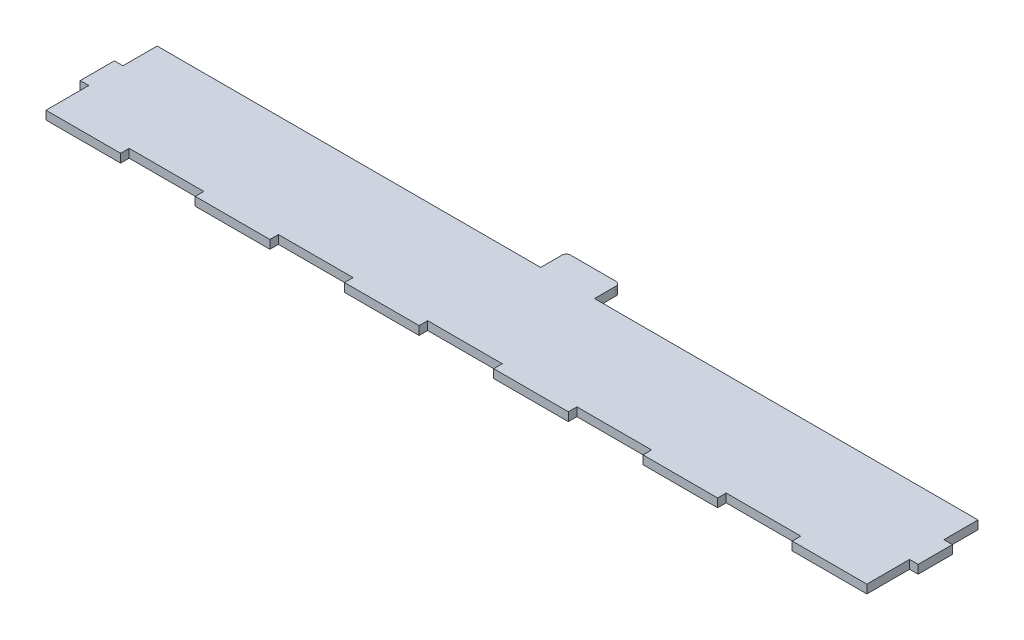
ISO-10303-21;
HEADER;
FILE_DESCRIPTION(('STEP AP214'),'2;1');
FILE_NAME('part.step','',(''),(''),'','','');
FILE_SCHEMA(('AUTOMOTIVE_DESIGN { 1 0 10303 214 1 1 1 1 }'));
ENDSEC;
DATA;
#1=APPLICATION_CONTEXT('core data for automotive mechanical design processes');
#2=APPLICATION_PROTOCOL_DEFINITION('international standard','automotive_design',2000,#1);
#3=PRODUCT_CONTEXT('',#1,'mechanical');
#4=PRODUCT('Part','Part','',(#3));
#5=PRODUCT_RELATED_PRODUCT_CATEGORY('part','',(#4));
#6=PRODUCT_DEFINITION_FORMATION('','',#4);
#7=PRODUCT_DEFINITION_CONTEXT('part definition',#1,'design');
#8=PRODUCT_DEFINITION('design','',#6,#7);
#9=PRODUCT_DEFINITION_SHAPE('','',#8);
#10=(LENGTH_UNIT() NAMED_UNIT(*) SI_UNIT(.MILLI.,.METRE.));
#11=(NAMED_UNIT(*) PLANE_ANGLE_UNIT() SI_UNIT($,.RADIAN.));
#12=(NAMED_UNIT(*) SI_UNIT($,.STERADIAN.) SOLID_ANGLE_UNIT());
#13=UNCERTAINTY_MEASURE_WITH_UNIT(LENGTH_MEASURE(1.E-05),#10,'distance_accuracy_value','');
#14=(GEOMETRIC_REPRESENTATION_CONTEXT(3) GLOBAL_UNCERTAINTY_ASSIGNED_CONTEXT((#13)) GLOBAL_UNIT_ASSIGNED_CONTEXT((#10,
#11,#12)) REPRESENTATION_CONTEXT('',''));
#15=CARTESIAN_POINT('',(0.,0.,0.));
#16=DIRECTION('',(0.,0.,1.));
#17=DIRECTION('',(1.,0.,0.));
#18=AXIS2_PLACEMENT_3D('',#15,#16,#17);
#19=CARTESIAN_POINT('',(-152.4,3.175,-25.4));
#20=DIRECTION('',(1.,0.,0.));
#21=DIRECTION('',(0.,0.,-1.));
#22=AXIS2_PLACEMENT_3D('',#19,#20,#21);
#23=PLANE('',#22);
#24=DIRECTION('',(0.,0.,1.));
#25=VECTOR('',#24,1.);
#26=CARTESIAN_POINT('',(-152.4,0.,-25.4));
#27=LINE('',#26,#25);
#28=CARTESIAN_POINT('',(-152.4,0.,-38.1));
#29=VERTEX_POINT('',#28);
#30=CARTESIAN_POINT('',(-152.4,0.,-25.4));
#31=VERTEX_POINT('',#30);
#32=EDGE_CURVE('E603',#29,#31,#27,.T.);
#33=ORIENTED_EDGE('',*,*,#32,.T.);
#34=DIRECTION('',(0.,-1.,0.));
#35=VECTOR('',#34,1.);
#36=CARTESIAN_POINT('',(-152.4,3.175,-25.4));
#37=LINE('',#36,#35);
#38=CARTESIAN_POINT('',(-152.4,3.175,-25.4));
#39=VERTEX_POINT('',#38);
#40=EDGE_CURVE('E12',#39,#31,#37,.T.);
#41=ORIENTED_EDGE('',*,*,#40,.F.);
#42=DIRECTION('',(0.,0.,1.));
#43=VECTOR('',#42,1.);
#44=CARTESIAN_POINT('',(-152.4,3.175,-25.4));
#45=LINE('',#44,#43);
#46=CARTESIAN_POINT('',(-152.4,3.175,-38.1));
#47=VERTEX_POINT('',#46);
#48=EDGE_CURVE('E479',#47,#39,#45,.T.);
#49=ORIENTED_EDGE('',*,*,#48,.F.);
#50=DIRECTION('',(0.,-1.,0.));
#51=VECTOR('',#50,1.);
#52=CARTESIAN_POINT('',(-152.4,3.175,-38.1));
#53=LINE('',#52,#51);
#54=EDGE_CURVE('E311',#47,#29,#53,.T.);
#55=ORIENTED_EDGE('',*,*,#54,.T.);
#56=EDGE_LOOP('',(#33,#41,#49,#55));
#57=FACE_BOUND('',#56,.T.);
#58=ADVANCED_FACE('F36',(#57),#23,.F.);
#59=CARTESIAN_POINT('',(-155.575,3.175,-25.4));
#60=DIRECTION('',(0.,0.,1.));
#61=DIRECTION('',(1.,0.,0.));
#62=AXIS2_PLACEMENT_3D('',#59,#60,#61);
#63=PLANE('',#62);
#64=DIRECTION('',(-1.,0.,0.));
#65=VECTOR('',#64,1.);
#66=CARTESIAN_POINT('',(-155.575,0.,-25.4));
#67=LINE('',#66,#65);
#68=CARTESIAN_POINT('',(-155.575,0.,-25.4));
#69=VERTEX_POINT('',#68);
#70=EDGE_CURVE('E597',#31,#69,#67,.T.);
#71=ORIENTED_EDGE('',*,*,#70,.T.);
#72=DIRECTION('',(0.,-1.,0.));
#73=VECTOR('',#72,1.);
#74=CARTESIAN_POINT('',(-155.575,3.175,-25.4));
#75=LINE('',#74,#73);
#76=CARTESIAN_POINT('',(-155.575,3.175,-25.4));
#77=VERTEX_POINT('',#76);
#78=EDGE_CURVE('E44',#77,#69,#75,.T.);
#79=ORIENTED_EDGE('',*,*,#78,.F.);
#80=DIRECTION('',(-1.,0.,0.));
#81=VECTOR('',#80,1.);
#82=CARTESIAN_POINT('',(-155.575,3.175,-25.4));
#83=LINE('',#82,#81);
#84=EDGE_CURVE('E185',#39,#77,#83,.T.);
#85=ORIENTED_EDGE('',*,*,#84,.F.);
#86=ORIENTED_EDGE('',*,*,#40,.T.);
#87=EDGE_LOOP('',(#71,#79,#85,#86));
#88=FACE_BOUND('',#87,.T.);
#89=ADVANCED_FACE('F684',(#88),#63,.F.);
#90=CARTESIAN_POINT('',(-155.575,3.175,-12.7));
#91=DIRECTION('',(1.,0.,0.));
#92=DIRECTION('',(0.,0.,-1.));
#93=AXIS2_PLACEMENT_3D('',#90,#91,#92);
#94=PLANE('',#93);
#95=DIRECTION('',(0.,0.,1.));
#96=VECTOR('',#95,1.);
#97=CARTESIAN_POINT('',(-155.575,0.,-12.7));
#98=LINE('',#97,#96);
#99=CARTESIAN_POINT('',(-155.575,0.,-12.7));
#100=VERTEX_POINT('',#99);
#101=EDGE_CURVE('E592',#69,#100,#98,.T.);
#102=ORIENTED_EDGE('',*,*,#101,.T.);
#103=DIRECTION('',(0.,-1.,0.));
#104=VECTOR('',#103,1.);
#105=CARTESIAN_POINT('',(-155.575,3.175,-12.7));
#106=LINE('',#105,#104);
#107=CARTESIAN_POINT('',(-155.575,3.175,-12.7));
#108=VERTEX_POINT('',#107);
#109=EDGE_CURVE('E584',#108,#100,#106,.T.);
#110=ORIENTED_EDGE('',*,*,#109,.F.);
#111=DIRECTION('',(0.,0.,1.));
#112=VECTOR('',#111,1.);
#113=CARTESIAN_POINT('',(-155.575,3.175,-12.7));
#114=LINE('',#113,#112);
#115=EDGE_CURVE('E473',#77,#108,#114,.T.);
#116=ORIENTED_EDGE('',*,*,#115,.F.);
#117=ORIENTED_EDGE('',*,*,#78,.T.);
#118=EDGE_LOOP('',(#102,#110,#116,#117));
#119=FACE_BOUND('',#118,.T.);
#120=ADVANCED_FACE('F590',(#119),#94,.F.);
#121=CARTESIAN_POINT('',(-152.4,3.175,-12.7));
#122=DIRECTION('',(0.,0.,-1.));
#123=DIRECTION('',(-1.,0.,0.));
#124=AXIS2_PLACEMENT_3D('',#121,#122,#123);
#125=PLANE('',#124);
#126=DIRECTION('',(1.,0.,0.));
#127=VECTOR('',#126,1.);
#128=CARTESIAN_POINT('',(-152.4,0.,-12.7));
#129=LINE('',#128,#127);
#130=CARTESIAN_POINT('',(-152.4,0.,-12.7));
#131=VERTEX_POINT('',#130);
#132=EDGE_CURVE('E599',#100,#131,#129,.T.);
#133=ORIENTED_EDGE('',*,*,#132,.T.);
#134=DIRECTION('',(0.,-1.,0.));
#135=VECTOR('',#134,1.);
#136=CARTESIAN_POINT('',(-152.4,3.175,-12.7));
#137=LINE('',#136,#135);
#138=CARTESIAN_POINT('',(-152.4,3.175,-12.7));
#139=VERTEX_POINT('',#138);
#140=EDGE_CURVE('E581',#139,#131,#137,.T.);
#141=ORIENTED_EDGE('',*,*,#140,.F.);
#142=DIRECTION('',(1.,0.,0.));
#143=VECTOR('',#142,1.);
#144=CARTESIAN_POINT('',(-152.4,3.175,-12.7));
#145=LINE('',#144,#143);
#146=EDGE_CURVE('E465',#108,#139,#145,.T.);
#147=ORIENTED_EDGE('',*,*,#146,.F.);
#148=ORIENTED_EDGE('',*,*,#109,.T.);
#149=EDGE_LOOP('',(#133,#141,#147,#148));
#150=FACE_BOUND('',#149,.T.);
#151=ADVANCED_FACE('F691',(#150),#125,.F.);
#152=CARTESIAN_POINT('',(-152.4,3.175,3.17500000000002));
#153=DIRECTION('',(1.,0.,0.));
#154=DIRECTION('',(0.,0.,-1.));
#155=AXIS2_PLACEMENT_3D('',#152,#153,#154);
#156=PLANE('',#155);
#157=DIRECTION('',(0.,0.,1.));
#158=VECTOR('',#157,1.);
#159=CARTESIAN_POINT('',(-152.4,0.,3.17500000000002));
#160=LINE('',#159,#158);
#161=CARTESIAN_POINT('',(-152.4,0.,3.17500000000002));
#162=VERTEX_POINT('',#161);
#163=EDGE_CURVE('E601',#131,#162,#160,.T.);
#164=ORIENTED_EDGE('',*,*,#163,.T.);
#165=DIRECTION('',(0.,-1.,0.));
#166=VECTOR('',#165,1.);
#167=CARTESIAN_POINT('',(-152.4,3.175,3.17500000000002));
#168=LINE('',#167,#166);
#169=CARTESIAN_POINT('',(-152.4,3.175,3.17500000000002));
#170=VERTEX_POINT('',#169);
#171=EDGE_CURVE('E578',#170,#162,#168,.T.);
#172=ORIENTED_EDGE('',*,*,#171,.F.);
#173=DIRECTION('',(0.,0.,1.));
#174=VECTOR('',#173,1.);
#175=CARTESIAN_POINT('',(-152.4,3.175,3.17500000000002));
#176=LINE('',#175,#174);
#177=EDGE_CURVE('E461',#139,#170,#176,.T.);
#178=ORIENTED_EDGE('',*,*,#177,.F.);
#179=ORIENTED_EDGE('',*,*,#140,.T.);
#180=EDGE_LOOP('',(#164,#172,#178,#179));
#181=FACE_BOUND('',#180,.T.);
#182=ADVANCED_FACE('F696',(#181),#156,.F.);
#183=CARTESIAN_POINT('',(-124.690909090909,3.175,3.17500000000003));
#184=DIRECTION('',(0.,0.,-1.));
#185=DIRECTION('',(-1.,0.,0.));
#186=AXIS2_PLACEMENT_3D('',#183,#184,#185);
#187=PLANE('',#186);
#188=DIRECTION('',(1.,0.,0.));
#189=VECTOR('',#188,1.);
#190=CARTESIAN_POINT('',(-124.690909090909,0.,3.17500000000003));
#191=LINE('',#190,#189);
#192=CARTESIAN_POINT('',(-124.690909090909,0.,3.17500000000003));
#193=VERTEX_POINT('',#192);
#194=EDGE_CURVE('E607',#162,#193,#191,.T.);
#195=ORIENTED_EDGE('',*,*,#194,.T.);
#196=DIRECTION('',(0.,-1.,0.));
#197=VECTOR('',#196,1.);
#198=CARTESIAN_POINT('',(-124.690909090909,3.175,3.17500000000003));
#199=LINE('',#198,#197);
#200=CARTESIAN_POINT('',(-124.690909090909,3.175,3.17500000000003));
#201=VERTEX_POINT('',#200);
#202=EDGE_CURVE('E575',#201,#193,#199,.T.);
#203=ORIENTED_EDGE('',*,*,#202,.F.);
#204=DIRECTION('',(1.,0.,0.));
#205=VECTOR('',#204,1.);
#206=CARTESIAN_POINT('',(-124.690909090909,3.175,3.17500000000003));
#207=LINE('',#206,#205);
#208=EDGE_CURVE('E457',#170,#201,#207,.T.);
#209=ORIENTED_EDGE('',*,*,#208,.F.);
#210=ORIENTED_EDGE('',*,*,#171,.T.);
#211=EDGE_LOOP('',(#195,#203,#209,#210));
#212=FACE_BOUND('',#211,.T.);
#213=ADVANCED_FACE('F700',(#212),#187,.F.);
#214=CARTESIAN_POINT('',(-124.690909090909,3.175,0.));
#215=DIRECTION('',(-1.,0.,0.));
#216=DIRECTION('',(0.,0.,1.));
#217=AXIS2_PLACEMENT_3D('',#214,#215,#216);
#218=PLANE('',#217);
#219=DIRECTION('',(0.,0.,-1.));
#220=VECTOR('',#219,1.);
#221=CARTESIAN_POINT('',(-124.690909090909,0.,0.));
#222=LINE('',#221,#220);
#223=CARTESIAN_POINT('',(-124.690909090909,0.,0.));
#224=VERTEX_POINT('',#223);
#225=EDGE_CURVE('E609',#193,#224,#222,.T.);
#226=ORIENTED_EDGE('',*,*,#225,.T.);
#227=DIRECTION('',(0.,-1.,0.));
#228=VECTOR('',#227,1.);
#229=CARTESIAN_POINT('',(-124.690909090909,3.175,0.));
#230=LINE('',#229,#228);
#231=CARTESIAN_POINT('',(-124.690909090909,3.175,0.));
#232=VERTEX_POINT('',#231);
#233=EDGE_CURVE('E572',#232,#224,#230,.T.);
#234=ORIENTED_EDGE('',*,*,#233,.F.);
#235=DIRECTION('',(0.,0.,-1.));
#236=VECTOR('',#235,1.);
#237=CARTESIAN_POINT('',(-124.690909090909,3.175,0.));
#238=LINE('',#237,#236);
#239=EDGE_CURVE('E454',#201,#232,#238,.T.);
#240=ORIENTED_EDGE('',*,*,#239,.F.);
#241=ORIENTED_EDGE('',*,*,#202,.T.);
#242=EDGE_LOOP('',(#226,#234,#240,#241));
#243=FACE_BOUND('',#242,.T.);
#244=ADVANCED_FACE('F704',(#243),#218,.F.);
#245=CARTESIAN_POINT('',(-96.9818181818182,3.175,0.));
#246=DIRECTION('',(0.,0.,-1.));
#247=DIRECTION('',(-1.,0.,0.));
#248=AXIS2_PLACEMENT_3D('',#245,#246,#247);
#249=PLANE('',#248);
#250=DIRECTION('',(1.,0.,0.));
#251=VECTOR('',#250,1.);
#252=CARTESIAN_POINT('',(-96.9818181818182,0.,0.));
#253=LINE('',#252,#251);
#254=CARTESIAN_POINT('',(-96.9818181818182,0.,0.));
#255=VERTEX_POINT('',#254);
#256=EDGE_CURVE('E611',#224,#255,#253,.T.);
#257=ORIENTED_EDGE('',*,*,#256,.T.);
#258=DIRECTION('',(0.,-1.,0.));
#259=VECTOR('',#258,1.);
#260=CARTESIAN_POINT('',(-96.9818181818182,3.175,0.));
#261=LINE('',#260,#259);
#262=CARTESIAN_POINT('',(-96.9818181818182,3.175,0.));
#263=VERTEX_POINT('',#262);
#264=EDGE_CURVE('E569',#263,#255,#261,.T.);
#265=ORIENTED_EDGE('',*,*,#264,.F.);
#266=DIRECTION('',(1.,0.,0.));
#267=VECTOR('',#266,1.);
#268=CARTESIAN_POINT('',(-96.9818181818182,3.175,0.));
#269=LINE('',#268,#267);
#270=EDGE_CURVE('E446',#232,#263,#269,.T.);
#271=ORIENTED_EDGE('',*,*,#270,.F.);
#272=ORIENTED_EDGE('',*,*,#233,.T.);
#273=EDGE_LOOP('',(#257,#265,#271,#272));
#274=FACE_BOUND('',#273,.T.);
#275=ADVANCED_FACE('F708',(#274),#249,.F.);
#276=CARTESIAN_POINT('',(-96.9818181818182,3.175,3.17500000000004));
#277=DIRECTION('',(1.,0.,0.));
#278=DIRECTION('',(0.,0.,-1.));
#279=AXIS2_PLACEMENT_3D('',#276,#277,#278);
#280=PLANE('',#279);
#281=DIRECTION('',(0.,0.,1.));
#282=VECTOR('',#281,1.);
#283=CARTESIAN_POINT('',(-96.9818181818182,0.,3.17500000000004));
#284=LINE('',#283,#282);
#285=CARTESIAN_POINT('',(-96.9818181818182,0.,3.17500000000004));
#286=VERTEX_POINT('',#285);
#287=EDGE_CURVE('E613',#255,#286,#284,.T.);
#288=ORIENTED_EDGE('',*,*,#287,.T.);
#289=DIRECTION('',(0.,-1.,0.));
#290=VECTOR('',#289,1.);
#291=CARTESIAN_POINT('',(-96.9818181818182,3.175,3.17500000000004));
#292=LINE('',#291,#290);
#293=CARTESIAN_POINT('',(-96.9818181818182,3.175,3.17500000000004));
#294=VERTEX_POINT('',#293);
#295=EDGE_CURVE('E566',#294,#286,#292,.T.);
#296=ORIENTED_EDGE('',*,*,#295,.F.);
#297=DIRECTION('',(0.,0.,1.));
#298=VECTOR('',#297,1.);
#299=CARTESIAN_POINT('',(-96.9818181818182,3.175,3.17500000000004));
#300=LINE('',#299,#298);
#301=EDGE_CURVE('E442',#263,#294,#300,.T.);
#302=ORIENTED_EDGE('',*,*,#301,.F.);
#303=ORIENTED_EDGE('',*,*,#264,.T.);
#304=EDGE_LOOP('',(#288,#296,#302,#303));
#305=FACE_BOUND('',#304,.T.);
#306=ADVANCED_FACE('F712',(#305),#280,.F.);
#307=CARTESIAN_POINT('',(-69.2727272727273,3.175,3.17500000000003));
#308=DIRECTION('',(0.,0.,-1.));
#309=DIRECTION('',(-1.,0.,0.));
#310=AXIS2_PLACEMENT_3D('',#307,#308,#309);
#311=PLANE('',#310);
#312=DIRECTION('',(1.,0.,0.));
#313=VECTOR('',#312,1.);
#314=CARTESIAN_POINT('',(-69.2727272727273,0.,3.17500000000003));
#315=LINE('',#314,#313);
#316=CARTESIAN_POINT('',(-69.2727272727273,0.,3.17500000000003));
#317=VERTEX_POINT('',#316);
#318=EDGE_CURVE('E615',#286,#317,#315,.T.);
#319=ORIENTED_EDGE('',*,*,#318,.T.);
#320=DIRECTION('',(0.,-1.,0.));
#321=VECTOR('',#320,1.);
#322=CARTESIAN_POINT('',(-69.2727272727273,3.175,3.17500000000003));
#323=LINE('',#322,#321);
#324=CARTESIAN_POINT('',(-69.2727272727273,3.175,3.17500000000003));
#325=VERTEX_POINT('',#324);
#326=EDGE_CURVE('E563',#325,#317,#323,.T.);
#327=ORIENTED_EDGE('',*,*,#326,.F.);
#328=DIRECTION('',(1.,0.,0.));
#329=VECTOR('',#328,1.);
#330=CARTESIAN_POINT('',(-69.2727272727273,3.175,3.17500000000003));
#331=LINE('',#330,#329);
#332=EDGE_CURVE('E438',#294,#325,#331,.T.);
#333=ORIENTED_EDGE('',*,*,#332,.F.);
#334=ORIENTED_EDGE('',*,*,#295,.T.);
#335=EDGE_LOOP('',(#319,#327,#333,#334));
#336=FACE_BOUND('',#335,.T.);
#337=ADVANCED_FACE('F716',(#336),#311,.F.);
#338=CARTESIAN_POINT('',(-69.2727272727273,3.175,0.));
#339=DIRECTION('',(-1.,0.,0.));
#340=DIRECTION('',(0.,0.,1.));
#341=AXIS2_PLACEMENT_3D('',#338,#339,#340);
#342=PLANE('',#341);
#343=DIRECTION('',(0.,0.,-1.));
#344=VECTOR('',#343,1.);
#345=CARTESIAN_POINT('',(-69.2727272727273,0.,0.));
#346=LINE('',#345,#344);
#347=CARTESIAN_POINT('',(-69.2727272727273,0.,0.));
#348=VERTEX_POINT('',#347);
#349=EDGE_CURVE('E617',#317,#348,#346,.T.);
#350=ORIENTED_EDGE('',*,*,#349,.T.);
#351=DIRECTION('',(0.,-1.,0.));
#352=VECTOR('',#351,1.);
#353=CARTESIAN_POINT('',(-69.2727272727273,3.175,0.));
#354=LINE('',#353,#352);
#355=CARTESIAN_POINT('',(-69.2727272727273,3.175,0.));
#356=VERTEX_POINT('',#355);
#357=EDGE_CURVE('E560',#356,#348,#354,.T.);
#358=ORIENTED_EDGE('',*,*,#357,.F.);
#359=DIRECTION('',(0.,0.,-1.));
#360=VECTOR('',#359,1.);
#361=CARTESIAN_POINT('',(-69.2727272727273,3.175,0.));
#362=LINE('',#361,#360);
#363=EDGE_CURVE('E435',#325,#356,#362,.T.);
#364=ORIENTED_EDGE('',*,*,#363,.F.);
#365=ORIENTED_EDGE('',*,*,#326,.T.);
#366=EDGE_LOOP('',(#350,#358,#364,#365));
#367=FACE_BOUND('',#366,.T.);
#368=ADVANCED_FACE('F720',(#367),#342,.F.);
#369=CARTESIAN_POINT('',(-41.5636363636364,3.175,0.));
#370=DIRECTION('',(0.,0.,-1.));
#371=DIRECTION('',(-1.,0.,0.));
#372=AXIS2_PLACEMENT_3D('',#369,#370,#371);
#373=PLANE('',#372);
#374=DIRECTION('',(1.,0.,0.));
#375=VECTOR('',#374,1.);
#376=CARTESIAN_POINT('',(-41.5636363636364,0.,0.));
#377=LINE('',#376,#375);
#378=CARTESIAN_POINT('',(-41.5636363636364,0.,0.));
#379=VERTEX_POINT('',#378);
#380=EDGE_CURVE('E619',#348,#379,#377,.T.);
#381=ORIENTED_EDGE('',*,*,#380,.T.);
#382=DIRECTION('',(0.,-1.,0.));
#383=VECTOR('',#382,1.);
#384=CARTESIAN_POINT('',(-41.5636363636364,3.175,0.));
#385=LINE('',#384,#383);
#386=CARTESIAN_POINT('',(-41.5636363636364,3.175,0.));
#387=VERTEX_POINT('',#386);
#388=EDGE_CURVE('E557',#387,#379,#385,.T.);
#389=ORIENTED_EDGE('',*,*,#388,.F.);
#390=DIRECTION('',(1.,0.,0.));
#391=VECTOR('',#390,1.);
#392=CARTESIAN_POINT('',(-41.5636363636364,3.175,0.));
#393=LINE('',#392,#391);
#394=EDGE_CURVE('E427',#356,#387,#393,.T.);
#395=ORIENTED_EDGE('',*,*,#394,.F.);
#396=ORIENTED_EDGE('',*,*,#357,.T.);
#397=EDGE_LOOP('',(#381,#389,#395,#396));
#398=FACE_BOUND('',#397,.T.);
#399=ADVANCED_FACE('F724',(#398),#373,.F.);
#400=CARTESIAN_POINT('',(-41.5636363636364,3.175,3.17500000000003));
#401=DIRECTION('',(1.,0.,0.));
#402=DIRECTION('',(0.,0.,-1.));
#403=AXIS2_PLACEMENT_3D('',#400,#401,#402);
#404=PLANE('',#403);
#405=DIRECTION('',(0.,0.,1.));
#406=VECTOR('',#405,1.);
#407=CARTESIAN_POINT('',(-41.5636363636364,0.,3.17500000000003));
#408=LINE('',#407,#406);
#409=CARTESIAN_POINT('',(-41.5636363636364,0.,3.17500000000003));
#410=VERTEX_POINT('',#409);
#411=EDGE_CURVE('E621',#379,#410,#408,.T.);
#412=ORIENTED_EDGE('',*,*,#411,.T.);
#413=DIRECTION('',(0.,-1.,0.));
#414=VECTOR('',#413,1.);
#415=CARTESIAN_POINT('',(-41.5636363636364,3.175,3.17500000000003));
#416=LINE('',#415,#414);
#417=CARTESIAN_POINT('',(-41.5636363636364,3.175,3.17500000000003));
#418=VERTEX_POINT('',#417);
#419=EDGE_CURVE('E554',#418,#410,#416,.T.);
#420=ORIENTED_EDGE('',*,*,#419,.F.);
#421=DIRECTION('',(0.,0.,1.));
#422=VECTOR('',#421,1.);
#423=CARTESIAN_POINT('',(-41.5636363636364,3.175,3.17500000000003));
#424=LINE('',#423,#422);
#425=EDGE_CURVE('E423',#387,#418,#424,.T.);
#426=ORIENTED_EDGE('',*,*,#425,.F.);
#427=ORIENTED_EDGE('',*,*,#388,.T.);
#428=EDGE_LOOP('',(#412,#420,#426,#427));
#429=FACE_BOUND('',#428,.T.);
#430=ADVANCED_FACE('F728',(#429),#404,.F.);
#431=CARTESIAN_POINT('',(-13.8545454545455,3.175,3.17500000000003));
#432=DIRECTION('',(0.,0.,-1.));
#433=DIRECTION('',(-1.,0.,0.));
#434=AXIS2_PLACEMENT_3D('',#431,#432,#433);
#435=PLANE('',#434);
#436=DIRECTION('',(1.,0.,0.));
#437=VECTOR('',#436,1.);
#438=CARTESIAN_POINT('',(-13.8545454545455,0.,3.17500000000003));
#439=LINE('',#438,#437);
#440=CARTESIAN_POINT('',(-13.8545454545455,0.,3.17500000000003));
#441=VERTEX_POINT('',#440);
#442=EDGE_CURVE('E623',#410,#441,#439,.T.);
#443=ORIENTED_EDGE('',*,*,#442,.T.);
#444=DIRECTION('',(0.,-1.,0.));
#445=VECTOR('',#444,1.);
#446=CARTESIAN_POINT('',(-13.8545454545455,3.175,3.17500000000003));
#447=LINE('',#446,#445);
#448=CARTESIAN_POINT('',(-13.8545454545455,3.175,3.17500000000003));
#449=VERTEX_POINT('',#448);
#450=EDGE_CURVE('E551',#449,#441,#447,.T.);
#451=ORIENTED_EDGE('',*,*,#450,.F.);
#452=DIRECTION('',(1.,0.,0.));
#453=VECTOR('',#452,1.);
#454=CARTESIAN_POINT('',(-13.8545454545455,3.175,3.17500000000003));
#455=LINE('',#454,#453);
#456=EDGE_CURVE('E419',#418,#449,#455,.T.);
#457=ORIENTED_EDGE('',*,*,#456,.F.);
#458=ORIENTED_EDGE('',*,*,#419,.T.);
#459=EDGE_LOOP('',(#443,#451,#457,#458));
#460=FACE_BOUND('',#459,.T.);
#461=ADVANCED_FACE('F732',(#460),#435,.F.);
#462=CARTESIAN_POINT('',(-13.8545454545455,3.175,0.));
#463=DIRECTION('',(-1.,0.,0.));
#464=DIRECTION('',(0.,0.,1.));
#465=AXIS2_PLACEMENT_3D('',#462,#463,#464);
#466=PLANE('',#465);
#467=DIRECTION('',(0.,0.,-1.));
#468=VECTOR('',#467,1.);
#469=CARTESIAN_POINT('',(-13.8545454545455,0.,0.));
#470=LINE('',#469,#468);
#471=CARTESIAN_POINT('',(-13.8545454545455,0.,0.));
#472=VERTEX_POINT('',#471);
#473=EDGE_CURVE('E625',#441,#472,#470,.T.);
#474=ORIENTED_EDGE('',*,*,#473,.T.);
#475=DIRECTION('',(0.,-1.,0.));
#476=VECTOR('',#475,1.);
#477=CARTESIAN_POINT('',(-13.8545454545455,3.175,0.));
#478=LINE('',#477,#476);
#479=CARTESIAN_POINT('',(-13.8545454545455,3.175,0.));
#480=VERTEX_POINT('',#479);
#481=EDGE_CURVE('E548',#480,#472,#478,.T.);
#482=ORIENTED_EDGE('',*,*,#481,.F.);
#483=DIRECTION('',(0.,0.,-1.));
#484=VECTOR('',#483,1.);
#485=CARTESIAN_POINT('',(-13.8545454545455,3.175,0.));
#486=LINE('',#485,#484);
#487=EDGE_CURVE('E416',#449,#480,#486,.T.);
#488=ORIENTED_EDGE('',*,*,#487,.F.);
#489=ORIENTED_EDGE('',*,*,#450,.T.);
#490=EDGE_LOOP('',(#474,#482,#488,#489));
#491=FACE_BOUND('',#490,.T.);
#492=ADVANCED_FACE('F736',(#491),#466,.F.);
#493=CARTESIAN_POINT('',(13.8545454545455,3.175,0.));
#494=DIRECTION('',(0.,0.,-1.));
#495=DIRECTION('',(-1.,0.,0.));
#496=AXIS2_PLACEMENT_3D('',#493,#494,#495);
#497=PLANE('',#496);
#498=DIRECTION('',(1.,0.,0.));
#499=VECTOR('',#498,1.);
#500=CARTESIAN_POINT('',(13.8545454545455,0.,0.));
#501=LINE('',#500,#499);
#502=CARTESIAN_POINT('',(13.8545454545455,0.,0.));
#503=VERTEX_POINT('',#502);
#504=EDGE_CURVE('E627',#472,#503,#501,.T.);
#505=ORIENTED_EDGE('',*,*,#504,.T.);
#506=DIRECTION('',(0.,-1.,0.));
#507=VECTOR('',#506,1.);
#508=CARTESIAN_POINT('',(13.8545454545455,3.175,0.));
#509=LINE('',#508,#507);
#510=CARTESIAN_POINT('',(13.8545454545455,3.175,0.));
#511=VERTEX_POINT('',#510);
#512=EDGE_CURVE('E545',#511,#503,#509,.T.);
#513=ORIENTED_EDGE('',*,*,#512,.F.);
#514=DIRECTION('',(1.,0.,0.));
#515=VECTOR('',#514,1.);
#516=CARTESIAN_POINT('',(13.8545454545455,3.175,0.));
#517=LINE('',#516,#515);
#518=EDGE_CURVE('E408',#480,#511,#517,.T.);
#519=ORIENTED_EDGE('',*,*,#518,.F.);
#520=ORIENTED_EDGE('',*,*,#481,.T.);
#521=EDGE_LOOP('',(#505,#513,#519,#520));
#522=FACE_BOUND('',#521,.T.);
#523=ADVANCED_FACE('F740',(#522),#497,.F.);
#524=CARTESIAN_POINT('',(13.8545454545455,3.175,3.17500000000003));
#525=DIRECTION('',(1.,0.,0.));
#526=DIRECTION('',(0.,0.,-1.));
#527=AXIS2_PLACEMENT_3D('',#524,#525,#526);
#528=PLANE('',#527);
#529=DIRECTION('',(0.,0.,1.));
#530=VECTOR('',#529,1.);
#531=CARTESIAN_POINT('',(13.8545454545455,0.,3.17500000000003));
#532=LINE('',#531,#530);
#533=CARTESIAN_POINT('',(13.8545454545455,0.,3.17500000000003));
#534=VERTEX_POINT('',#533);
#535=EDGE_CURVE('E629',#503,#534,#532,.T.);
#536=ORIENTED_EDGE('',*,*,#535,.T.);
#537=DIRECTION('',(0.,-1.,0.));
#538=VECTOR('',#537,1.);
#539=CARTESIAN_POINT('',(13.8545454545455,3.175,3.17500000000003));
#540=LINE('',#539,#538);
#541=CARTESIAN_POINT('',(13.8545454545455,3.175,3.17500000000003));
#542=VERTEX_POINT('',#541);
#543=EDGE_CURVE('E542',#542,#534,#540,.T.);
#544=ORIENTED_EDGE('',*,*,#543,.F.);
#545=DIRECTION('',(0.,0.,1.));
#546=VECTOR('',#545,1.);
#547=CARTESIAN_POINT('',(13.8545454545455,3.175,3.17500000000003));
#548=LINE('',#547,#546);
#549=EDGE_CURVE('E404',#511,#542,#548,.T.);
#550=ORIENTED_EDGE('',*,*,#549,.F.);
#551=ORIENTED_EDGE('',*,*,#512,.T.);
#552=EDGE_LOOP('',(#536,#544,#550,#551));
#553=FACE_BOUND('',#552,.T.);
#554=ADVANCED_FACE('F744',(#553),#528,.F.);
#555=CARTESIAN_POINT('',(41.5636363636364,3.175,3.17500000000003));
#556=DIRECTION('',(0.,0.,-1.));
#557=DIRECTION('',(-1.,0.,0.));
#558=AXIS2_PLACEMENT_3D('',#555,#556,#557);
#559=PLANE('',#558);
#560=DIRECTION('',(1.,0.,0.));
#561=VECTOR('',#560,1.);
#562=CARTESIAN_POINT('',(41.5636363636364,0.,3.17500000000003));
#563=LINE('',#562,#561);
#564=CARTESIAN_POINT('',(41.5636363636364,0.,3.17500000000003));
#565=VERTEX_POINT('',#564);
#566=EDGE_CURVE('E631',#534,#565,#563,.T.);
#567=ORIENTED_EDGE('',*,*,#566,.T.);
#568=DIRECTION('',(0.,-1.,0.));
#569=VECTOR('',#568,1.);
#570=CARTESIAN_POINT('',(41.5636363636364,3.175,3.17500000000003));
#571=LINE('',#570,#569);
#572=CARTESIAN_POINT('',(41.5636363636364,3.175,3.17500000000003));
#573=VERTEX_POINT('',#572);
#574=EDGE_CURVE('E539',#573,#565,#571,.T.);
#575=ORIENTED_EDGE('',*,*,#574,.F.);
#576=DIRECTION('',(1.,0.,0.));
#577=VECTOR('',#576,1.);
#578=CARTESIAN_POINT('',(41.5636363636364,3.175,3.17500000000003));
#579=LINE('',#578,#577);
#580=EDGE_CURVE('E400',#542,#573,#579,.T.);
#581=ORIENTED_EDGE('',*,*,#580,.F.);
#582=ORIENTED_EDGE('',*,*,#543,.T.);
#583=EDGE_LOOP('',(#567,#575,#581,#582));
#584=FACE_BOUND('',#583,.T.);
#585=ADVANCED_FACE('F748',(#584),#559,.F.);
#586=CARTESIAN_POINT('',(41.5636363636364,3.175,0.));
#587=DIRECTION('',(-1.,0.,0.));
#588=DIRECTION('',(0.,0.,1.));
#589=AXIS2_PLACEMENT_3D('',#586,#587,#588);
#590=PLANE('',#589);
#591=DIRECTION('',(0.,0.,-1.));
#592=VECTOR('',#591,1.);
#593=CARTESIAN_POINT('',(41.5636363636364,0.,0.));
#594=LINE('',#593,#592);
#595=CARTESIAN_POINT('',(41.5636363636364,0.,0.));
#596=VERTEX_POINT('',#595);
#597=EDGE_CURVE('E633',#565,#596,#594,.T.);
#598=ORIENTED_EDGE('',*,*,#597,.T.);
#599=DIRECTION('',(0.,-1.,0.));
#600=VECTOR('',#599,1.);
#601=CARTESIAN_POINT('',(41.5636363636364,3.175,0.));
#602=LINE('',#601,#600);
#603=CARTESIAN_POINT('',(41.5636363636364,3.175,0.));
#604=VERTEX_POINT('',#603);
#605=EDGE_CURVE('E536',#604,#596,#602,.T.);
#606=ORIENTED_EDGE('',*,*,#605,.F.);
#607=DIRECTION('',(0.,0.,-1.));
#608=VECTOR('',#607,1.);
#609=CARTESIAN_POINT('',(41.5636363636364,3.175,0.));
#610=LINE('',#609,#608);
#611=EDGE_CURVE('E397',#573,#604,#610,.T.);
#612=ORIENTED_EDGE('',*,*,#611,.F.);
#613=ORIENTED_EDGE('',*,*,#574,.T.);
#614=EDGE_LOOP('',(#598,#606,#612,#613));
#615=FACE_BOUND('',#614,.T.);
#616=ADVANCED_FACE('F752',(#615),#590,.F.);
#617=CARTESIAN_POINT('',(69.2727272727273,3.175,0.));
#618=DIRECTION('',(0.,0.,-1.));
#619=DIRECTION('',(-1.,0.,0.));
#620=AXIS2_PLACEMENT_3D('',#617,#618,#619);
#621=PLANE('',#620);
#622=DIRECTION('',(1.,0.,0.));
#623=VECTOR('',#622,1.);
#624=CARTESIAN_POINT('',(69.2727272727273,0.,0.));
#625=LINE('',#624,#623);
#626=CARTESIAN_POINT('',(69.2727272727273,0.,0.));
#627=VERTEX_POINT('',#626);
#628=EDGE_CURVE('E635',#596,#627,#625,.T.);
#629=ORIENTED_EDGE('',*,*,#628,.T.);
#630=DIRECTION('',(0.,-1.,0.));
#631=VECTOR('',#630,1.);
#632=CARTESIAN_POINT('',(69.2727272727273,3.175,0.));
#633=LINE('',#632,#631);
#634=CARTESIAN_POINT('',(69.2727272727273,3.175,0.));
#635=VERTEX_POINT('',#634);
#636=EDGE_CURVE('E533',#635,#627,#633,.T.);
#637=ORIENTED_EDGE('',*,*,#636,.F.);
#638=DIRECTION('',(1.,0.,0.));
#639=VECTOR('',#638,1.);
#640=CARTESIAN_POINT('',(69.2727272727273,3.175,0.));
#641=LINE('',#640,#639);
#642=EDGE_CURVE('E389',#604,#635,#641,.T.);
#643=ORIENTED_EDGE('',*,*,#642,.F.);
#644=ORIENTED_EDGE('',*,*,#605,.T.);
#645=EDGE_LOOP('',(#629,#637,#643,#644));
#646=FACE_BOUND('',#645,.T.);
#647=ADVANCED_FACE('F756',(#646),#621,.F.);
#648=CARTESIAN_POINT('',(69.2727272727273,3.175,3.17500000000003));
#649=DIRECTION('',(1.,0.,0.));
#650=DIRECTION('',(0.,0.,-1.));
#651=AXIS2_PLACEMENT_3D('',#648,#649,#650);
#652=PLANE('',#651);
#653=DIRECTION('',(0.,0.,1.));
#654=VECTOR('',#653,1.);
#655=CARTESIAN_POINT('',(69.2727272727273,0.,3.17500000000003));
#656=LINE('',#655,#654);
#657=CARTESIAN_POINT('',(69.2727272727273,0.,3.17500000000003));
#658=VERTEX_POINT('',#657);
#659=EDGE_CURVE('E637',#627,#658,#656,.T.);
#660=ORIENTED_EDGE('',*,*,#659,.T.);
#661=DIRECTION('',(0.,-1.,0.));
#662=VECTOR('',#661,1.);
#663=CARTESIAN_POINT('',(69.2727272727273,3.175,3.17500000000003));
#664=LINE('',#663,#662);
#665=CARTESIAN_POINT('',(69.2727272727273,3.175,3.17500000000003));
#666=VERTEX_POINT('',#665);
#667=EDGE_CURVE('E530',#666,#658,#664,.T.);
#668=ORIENTED_EDGE('',*,*,#667,.F.);
#669=DIRECTION('',(0.,0.,1.));
#670=VECTOR('',#669,1.);
#671=CARTESIAN_POINT('',(69.2727272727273,3.175,3.17500000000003));
#672=LINE('',#671,#670);
#673=EDGE_CURVE('E385',#635,#666,#672,.T.);
#674=ORIENTED_EDGE('',*,*,#673,.F.);
#675=ORIENTED_EDGE('',*,*,#636,.T.);
#676=EDGE_LOOP('',(#660,#668,#674,#675));
#677=FACE_BOUND('',#676,.T.);
#678=ADVANCED_FACE('F760',(#677),#652,.F.);
#679=CARTESIAN_POINT('',(96.9818181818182,3.175,3.17500000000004));
#680=DIRECTION('',(0.,0.,-1.));
#681=DIRECTION('',(-1.,0.,0.));
#682=AXIS2_PLACEMENT_3D('',#679,#680,#681);
#683=PLANE('',#682);
#684=DIRECTION('',(1.,0.,0.));
#685=VECTOR('',#684,1.);
#686=CARTESIAN_POINT('',(96.9818181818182,0.,3.17500000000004));
#687=LINE('',#686,#685);
#688=CARTESIAN_POINT('',(96.9818181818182,0.,3.17500000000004));
#689=VERTEX_POINT('',#688);
#690=EDGE_CURVE('E639',#658,#689,#687,.T.);
#691=ORIENTED_EDGE('',*,*,#690,.T.);
#692=DIRECTION('',(0.,-1.,0.));
#693=VECTOR('',#692,1.);
#694=CARTESIAN_POINT('',(96.9818181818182,3.175,3.17500000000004));
#695=LINE('',#694,#693);
#696=CARTESIAN_POINT('',(96.9818181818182,3.175,3.17500000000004));
#697=VERTEX_POINT('',#696);
#698=EDGE_CURVE('E527',#697,#689,#695,.T.);
#699=ORIENTED_EDGE('',*,*,#698,.F.);
#700=DIRECTION('',(1.,0.,0.));
#701=VECTOR('',#700,1.);
#702=CARTESIAN_POINT('',(96.9818181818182,3.175,3.17500000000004));
#703=LINE('',#702,#701);
#704=EDGE_CURVE('E381',#666,#697,#703,.T.);
#705=ORIENTED_EDGE('',*,*,#704,.F.);
#706=ORIENTED_EDGE('',*,*,#667,.T.);
#707=EDGE_LOOP('',(#691,#699,#705,#706));
#708=FACE_BOUND('',#707,.T.);
#709=ADVANCED_FACE('F764',(#708),#683,.F.);
#710=CARTESIAN_POINT('',(96.9818181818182,3.175,0.));
#711=DIRECTION('',(-1.,0.,0.));
#712=DIRECTION('',(0.,0.,1.));
#713=AXIS2_PLACEMENT_3D('',#710,#711,#712);
#714=PLANE('',#713);
#715=DIRECTION('',(0.,0.,-1.));
#716=VECTOR('',#715,1.);
#717=CARTESIAN_POINT('',(96.9818181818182,0.,0.));
#718=LINE('',#717,#716);
#719=CARTESIAN_POINT('',(96.9818181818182,0.,0.));
#720=VERTEX_POINT('',#719);
#721=EDGE_CURVE('E641',#689,#720,#718,.T.);
#722=ORIENTED_EDGE('',*,*,#721,.T.);
#723=DIRECTION('',(0.,-1.,0.));
#724=VECTOR('',#723,1.);
#725=CARTESIAN_POINT('',(96.9818181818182,3.175,0.));
#726=LINE('',#725,#724);
#727=CARTESIAN_POINT('',(96.9818181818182,3.175,0.));
#728=VERTEX_POINT('',#727);
#729=EDGE_CURVE('E524',#728,#720,#726,.T.);
#730=ORIENTED_EDGE('',*,*,#729,.F.);
#731=DIRECTION('',(0.,0.,-1.));
#732=VECTOR('',#731,1.);
#733=CARTESIAN_POINT('',(96.9818181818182,3.175,0.));
#734=LINE('',#733,#732);
#735=EDGE_CURVE('E378',#697,#728,#734,.T.);
#736=ORIENTED_EDGE('',*,*,#735,.F.);
#737=ORIENTED_EDGE('',*,*,#698,.T.);
#738=EDGE_LOOP('',(#722,#730,#736,#737));
#739=FACE_BOUND('',#738,.T.);
#740=ADVANCED_FACE('F768',(#739),#714,.F.);
#741=CARTESIAN_POINT('',(124.690909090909,3.175,0.));
#742=DIRECTION('',(0.,0.,-1.));
#743=DIRECTION('',(-1.,0.,0.));
#744=AXIS2_PLACEMENT_3D('',#741,#742,#743);
#745=PLANE('',#744);
#746=DIRECTION('',(1.,0.,0.));
#747=VECTOR('',#746,1.);
#748=CARTESIAN_POINT('',(124.690909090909,0.,0.));
#749=LINE('',#748,#747);
#750=CARTESIAN_POINT('',(124.690909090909,0.,0.));
#751=VERTEX_POINT('',#750);
#752=EDGE_CURVE('E643',#720,#751,#749,.T.);
#753=ORIENTED_EDGE('',*,*,#752,.T.);
#754=DIRECTION('',(0.,-1.,0.));
#755=VECTOR('',#754,1.);
#756=CARTESIAN_POINT('',(124.690909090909,3.175,0.));
#757=LINE('',#756,#755);
#758=CARTESIAN_POINT('',(124.690909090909,3.175,0.));
#759=VERTEX_POINT('',#758);
#760=EDGE_CURVE('E521',#759,#751,#757,.T.);
#761=ORIENTED_EDGE('',*,*,#760,.F.);
#762=DIRECTION('',(1.,0.,0.));
#763=VECTOR('',#762,1.);
#764=CARTESIAN_POINT('',(124.690909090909,3.175,0.));
#765=LINE('',#764,#763);
#766=EDGE_CURVE('E370',#728,#759,#765,.T.);
#767=ORIENTED_EDGE('',*,*,#766,.F.);
#768=ORIENTED_EDGE('',*,*,#729,.T.);
#769=EDGE_LOOP('',(#753,#761,#767,#768));
#770=FACE_BOUND('',#769,.T.);
#771=ADVANCED_FACE('F772',(#770),#745,.F.);
#772=CARTESIAN_POINT('',(124.690909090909,3.175,3.17500000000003));
#773=DIRECTION('',(1.,0.,0.));
#774=DIRECTION('',(0.,0.,-1.));
#775=AXIS2_PLACEMENT_3D('',#772,#773,#774);
#776=PLANE('',#775);
#777=DIRECTION('',(0.,0.,1.));
#778=VECTOR('',#777,1.);
#779=CARTESIAN_POINT('',(124.690909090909,0.,3.17500000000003));
#780=LINE('',#779,#778);
#781=CARTESIAN_POINT('',(124.690909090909,0.,3.17500000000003));
#782=VERTEX_POINT('',#781);
#783=EDGE_CURVE('E645',#751,#782,#780,.T.);
#784=ORIENTED_EDGE('',*,*,#783,.T.);
#785=DIRECTION('',(0.,-1.,0.));
#786=VECTOR('',#785,1.);
#787=CARTESIAN_POINT('',(124.690909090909,3.175,3.17500000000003));
#788=LINE('',#787,#786);
#789=CARTESIAN_POINT('',(124.690909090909,3.175,3.17500000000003));
#790=VERTEX_POINT('',#789);
#791=EDGE_CURVE('E518',#790,#782,#788,.T.);
#792=ORIENTED_EDGE('',*,*,#791,.F.);
#793=DIRECTION('',(0.,0.,1.));
#794=VECTOR('',#793,1.);
#795=CARTESIAN_POINT('',(124.690909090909,3.175,3.17500000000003));
#796=LINE('',#795,#794);
#797=EDGE_CURVE('E366',#759,#790,#796,.T.);
#798=ORIENTED_EDGE('',*,*,#797,.F.);
#799=ORIENTED_EDGE('',*,*,#760,.T.);
#800=EDGE_LOOP('',(#784,#792,#798,#799));
#801=FACE_BOUND('',#800,.T.);
#802=ADVANCED_FACE('F776',(#801),#776,.F.);
#803=CARTESIAN_POINT('',(152.4,3.175,3.17500000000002));
#804=DIRECTION('',(0.,0.,-1.));
#805=DIRECTION('',(-1.,0.,0.));
#806=AXIS2_PLACEMENT_3D('',#803,#804,#805);
#807=PLANE('',#806);
#808=DIRECTION('',(1.,0.,0.));
#809=VECTOR('',#808,1.);
#810=CARTESIAN_POINT('',(152.4,0.,3.17500000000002));
#811=LINE('',#810,#809);
#812=CARTESIAN_POINT('',(152.4,0.,3.17500000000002));
#813=VERTEX_POINT('',#812);
#814=EDGE_CURVE('E647',#782,#813,#811,.T.);
#815=ORIENTED_EDGE('',*,*,#814,.T.);
#816=DIRECTION('',(0.,-1.,0.));
#817=VECTOR('',#816,1.);
#818=CARTESIAN_POINT('',(152.4,3.175,3.17500000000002));
#819=LINE('',#818,#817);
#820=CARTESIAN_POINT('',(152.4,3.175,3.17500000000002));
#821=VERTEX_POINT('',#820);
#822=EDGE_CURVE('E515',#821,#813,#819,.T.);
#823=ORIENTED_EDGE('',*,*,#822,.F.);
#824=DIRECTION('',(1.,0.,0.));
#825=VECTOR('',#824,1.);
#826=CARTESIAN_POINT('',(152.4,3.175,3.17500000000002));
#827=LINE('',#826,#825);
#828=EDGE_CURVE('E362',#790,#821,#827,.T.);
#829=ORIENTED_EDGE('',*,*,#828,.F.);
#830=ORIENTED_EDGE('',*,*,#791,.T.);
#831=EDGE_LOOP('',(#815,#823,#829,#830));
#832=FACE_BOUND('',#831,.T.);
#833=ADVANCED_FACE('F780',(#832),#807,.F.);
#834=CARTESIAN_POINT('',(152.4,3.175,-12.7));
#835=DIRECTION('',(-1.,0.,0.));
#836=DIRECTION('',(0.,0.,1.));
#837=AXIS2_PLACEMENT_3D('',#834,#835,#836);
#838=PLANE('',#837);
#839=DIRECTION('',(0.,0.,-1.));
#840=VECTOR('',#839,1.);
#841=CARTESIAN_POINT('',(152.4,0.,-12.7));
#842=LINE('',#841,#840);
#843=CARTESIAN_POINT('',(152.4,0.,-12.7));
#844=VERTEX_POINT('',#843);
#845=EDGE_CURVE('E649',#813,#844,#842,.T.);
#846=ORIENTED_EDGE('',*,*,#845,.T.);
#847=DIRECTION('',(0.,-1.,0.));
#848=VECTOR('',#847,1.);
#849=CARTESIAN_POINT('',(152.4,3.175,-12.7));
#850=LINE('',#849,#848);
#851=CARTESIAN_POINT('',(152.4,3.175,-12.7));
#852=VERTEX_POINT('',#851);
#853=EDGE_CURVE('E512',#852,#844,#850,.T.);
#854=ORIENTED_EDGE('',*,*,#853,.F.);
#855=DIRECTION('',(0.,0.,-1.));
#856=VECTOR('',#855,1.);
#857=CARTESIAN_POINT('',(152.4,3.175,-12.7));
#858=LINE('',#857,#856);
#859=EDGE_CURVE('E359',#821,#852,#858,.T.);
#860=ORIENTED_EDGE('',*,*,#859,.F.);
#861=ORIENTED_EDGE('',*,*,#822,.T.);
#862=EDGE_LOOP('',(#846,#854,#860,#861));
#863=FACE_BOUND('',#862,.T.);
#864=ADVANCED_FACE('F784',(#863),#838,.F.);
#865=CARTESIAN_POINT('',(155.575,3.175,-12.7));
#866=DIRECTION('',(0.,0.,-1.));
#867=DIRECTION('',(-1.,0.,0.));
#868=AXIS2_PLACEMENT_3D('',#865,#866,#867);
#869=PLANE('',#868);
#870=DIRECTION('',(1.,0.,0.));
#871=VECTOR('',#870,1.);
#872=CARTESIAN_POINT('',(155.575,0.,-12.7));
#873=LINE('',#872,#871);
#874=CARTESIAN_POINT('',(155.575,0.,-12.7));
#875=VERTEX_POINT('',#874);
#876=EDGE_CURVE('E651',#844,#875,#873,.T.);
#877=ORIENTED_EDGE('',*,*,#876,.T.);
#878=DIRECTION('',(0.,-1.,0.));
#879=VECTOR('',#878,1.);
#880=CARTESIAN_POINT('',(155.575,3.175,-12.7));
#881=LINE('',#880,#879);
#882=CARTESIAN_POINT('',(155.575,3.175,-12.7));
#883=VERTEX_POINT('',#882);
#884=EDGE_CURVE('E509',#883,#875,#881,.T.);
#885=ORIENTED_EDGE('',*,*,#884,.F.);
#886=DIRECTION('',(1.,0.,0.));
#887=VECTOR('',#886,1.);
#888=CARTESIAN_POINT('',(155.575,3.175,-12.7));
#889=LINE('',#888,#887);
#890=EDGE_CURVE('E351',#852,#883,#889,.T.);
#891=ORIENTED_EDGE('',*,*,#890,.F.);
#892=ORIENTED_EDGE('',*,*,#853,.T.);
#893=EDGE_LOOP('',(#877,#885,#891,#892));
#894=FACE_BOUND('',#893,.T.);
#895=ADVANCED_FACE('F788',(#894),#869,.F.);
#896=CARTESIAN_POINT('',(155.575,3.175,-25.4));
#897=DIRECTION('',(-1.,0.,0.));
#898=DIRECTION('',(0.,0.,1.));
#899=AXIS2_PLACEMENT_3D('',#896,#897,#898);
#900=PLANE('',#899);
#901=DIRECTION('',(0.,0.,-1.));
#902=VECTOR('',#901,1.);
#903=CARTESIAN_POINT('',(155.575,0.,-25.4));
#904=LINE('',#903,#902);
#905=CARTESIAN_POINT('',(155.575,0.,-25.4));
#906=VERTEX_POINT('',#905);
#907=EDGE_CURVE('E653',#875,#906,#904,.T.);
#908=ORIENTED_EDGE('',*,*,#907,.T.);
#909=DIRECTION('',(0.,-1.,0.));
#910=VECTOR('',#909,1.);
#911=CARTESIAN_POINT('',(155.575,3.175,-25.4));
#912=LINE('',#911,#910);
#913=CARTESIAN_POINT('',(155.575,3.175,-25.4));
#914=VERTEX_POINT('',#913);
#915=EDGE_CURVE('E506',#914,#906,#912,.T.);
#916=ORIENTED_EDGE('',*,*,#915,.F.);
#917=DIRECTION('',(0.,0.,-1.));
#918=VECTOR('',#917,1.);
#919=CARTESIAN_POINT('',(155.575,3.175,-25.4));
#920=LINE('',#919,#918);
#921=EDGE_CURVE('E347',#883,#914,#920,.T.);
#922=ORIENTED_EDGE('',*,*,#921,.F.);
#923=ORIENTED_EDGE('',*,*,#884,.T.);
#924=EDGE_LOOP('',(#908,#916,#922,#923));
#925=FACE_BOUND('',#924,.T.);
#926=ADVANCED_FACE('F792',(#925),#900,.F.);
#927=CARTESIAN_POINT('',(152.4,3.175,-25.4));
#928=DIRECTION('',(0.,0.,1.));
#929=DIRECTION('',(1.,0.,0.));
#930=AXIS2_PLACEMENT_3D('',#927,#928,#929);
#931=PLANE('',#930);
#932=DIRECTION('',(-1.,0.,0.));
#933=VECTOR('',#932,1.);
#934=CARTESIAN_POINT('',(152.4,0.,-25.4));
#935=LINE('',#934,#933);
#936=CARTESIAN_POINT('',(152.4,0.,-25.4));
#937=VERTEX_POINT('',#936);
#938=EDGE_CURVE('E655',#906,#937,#935,.T.);
#939=ORIENTED_EDGE('',*,*,#938,.T.);
#940=DIRECTION('',(0.,-1.,0.));
#941=VECTOR('',#940,1.);
#942=CARTESIAN_POINT('',(152.4,3.175,-25.4));
#943=LINE('',#942,#941);
#944=CARTESIAN_POINT('',(152.4,3.175,-25.4));
#945=VERTEX_POINT('',#944);
#946=EDGE_CURVE('E503',#945,#937,#943,.T.);
#947=ORIENTED_EDGE('',*,*,#946,.F.);
#948=DIRECTION('',(-1.,0.,0.));
#949=VECTOR('',#948,1.);
#950=CARTESIAN_POINT('',(152.4,3.175,-25.4));
#951=LINE('',#950,#949);
#952=EDGE_CURVE('E343',#914,#945,#951,.T.);
#953=ORIENTED_EDGE('',*,*,#952,.F.);
#954=ORIENTED_EDGE('',*,*,#915,.T.);
#955=EDGE_LOOP('',(#939,#947,#953,#954));
#956=FACE_BOUND('',#955,.T.);
#957=ADVANCED_FACE('F796',(#956),#931,.F.);
#958=CARTESIAN_POINT('',(152.4,3.175,-38.1));
#959=DIRECTION('',(-1.,0.,0.));
#960=DIRECTION('',(0.,0.,1.));
#961=AXIS2_PLACEMENT_3D('',#958,#959,#960);
#962=PLANE('',#961);
#963=DIRECTION('',(0.,0.,-1.));
#964=VECTOR('',#963,1.);
#965=CARTESIAN_POINT('',(152.4,0.,-38.1));
#966=LINE('',#965,#964);
#967=CARTESIAN_POINT('',(152.4,0.,-38.1));
#968=VERTEX_POINT('',#967);
#969=EDGE_CURVE('E657',#937,#968,#966,.T.);
#970=ORIENTED_EDGE('',*,*,#969,.T.);
#971=DIRECTION('',(0.,-1.,0.));
#972=VECTOR('',#971,1.);
#973=CARTESIAN_POINT('',(152.4,3.175,-38.1));
#974=LINE('',#973,#972);
#975=CARTESIAN_POINT('',(152.4,3.175,-38.1));
#976=VERTEX_POINT('',#975);
#977=EDGE_CURVE('E500',#976,#968,#974,.T.);
#978=ORIENTED_EDGE('',*,*,#977,.F.);
#979=DIRECTION('',(0.,0.,-1.));
#980=VECTOR('',#979,1.);
#981=CARTESIAN_POINT('',(152.4,3.175,-38.1));
#982=LINE('',#981,#980);
#983=EDGE_CURVE('E340',#945,#976,#982,.T.);
#984=ORIENTED_EDGE('',*,*,#983,.F.);
#985=ORIENTED_EDGE('',*,*,#946,.T.);
#986=EDGE_LOOP('',(#970,#978,#984,#985));
#987=FACE_BOUND('',#986,.T.);
#988=ADVANCED_FACE('F800',(#987),#962,.F.);
#989=CARTESIAN_POINT('',(152.4,3.175,-38.1));
#990=DIRECTION('',(0.,0.,1.));
#991=DIRECTION('',(1.,0.,0.));
#992=AXIS2_PLACEMENT_3D('',#989,#990,#991);
#993=PLANE('',#992);
#994=DIRECTION('',(-1.,0.,0.));
#995=VECTOR('',#994,1.);
#996=CARTESIAN_POINT('',(152.4,0.,-38.1));
#997=LINE('',#996,#995);
#998=CARTESIAN_POINT('',(10.,0.,-38.1));
#999=VERTEX_POINT('',#998);
#1000=EDGE_CURVE('E659',#968,#999,#997,.T.);
#1001=ORIENTED_EDGE('',*,*,#1000,.T.);
#1002=DIRECTION('',(0.,-1.,0.));
#1003=VECTOR('',#1002,1.);
#1004=CARTESIAN_POINT('',(10.,3.175,-38.1));
#1005=LINE('',#1004,#1003);
#1006=CARTESIAN_POINT('',(10.,3.175,-38.1));
#1007=VERTEX_POINT('',#1006);
#1008=EDGE_CURVE('E497',#1007,#999,#1005,.T.);
#1009=ORIENTED_EDGE('',*,*,#1008,.F.);
#1010=DIRECTION('',(-1.,0.,0.));
#1011=VECTOR('',#1010,1.);
#1012=CARTESIAN_POINT('',(152.4,3.175,-38.1));
#1013=LINE('',#1012,#1011);
#1014=EDGE_CURVE('E332',#976,#1007,#1013,.T.);
#1015=ORIENTED_EDGE('',*,*,#1014,.F.);
#1016=ORIENTED_EDGE('',*,*,#977,.T.);
#1017=EDGE_LOOP('',(#1001,#1009,#1015,#1016));
#1018=FACE_BOUND('',#1017,.T.);
#1019=ADVANCED_FACE('F804',(#1018),#993,.F.);
#1020=CARTESIAN_POINT('',(10.,3.175,-38.1));
#1021=DIRECTION('',(-1.,0.,0.));
#1022=DIRECTION('',(0.,0.,1.));
#1023=AXIS2_PLACEMENT_3D('',#1020,#1021,#1022);
#1024=PLANE('',#1023);
#1025=DIRECTION('',(0.,0.,-1.));
#1026=VECTOR('',#1025,1.);
#1027=CARTESIAN_POINT('',(10.,0.,-38.1));
#1028=LINE('',#1027,#1026);
#1029=CARTESIAN_POINT('',(10.,0.,-46.0375));
#1030=VERTEX_POINT('',#1029);
#1031=EDGE_CURVE('E661',#999,#1030,#1028,.T.);
#1032=ORIENTED_EDGE('',*,*,#1031,.T.);
#1033=DIRECTION('',(0.,-1.,0.));
#1034=VECTOR('',#1033,1.);
#1035=CARTESIAN_POINT('',(10.,3.175,-46.0375));
#1036=LINE('',#1035,#1034);
#1037=CARTESIAN_POINT('',(10.,3.175,-46.0375));
#1038=VERTEX_POINT('',#1037);
#1039=EDGE_CURVE('E494',#1038,#1030,#1036,.T.);
#1040=ORIENTED_EDGE('',*,*,#1039,.F.);
#1041=DIRECTION('',(0.,0.,-1.));
#1042=VECTOR('',#1041,1.);
#1043=CARTESIAN_POINT('',(10.,3.175,-38.1));
#1044=LINE('',#1043,#1042);
#1045=EDGE_CURVE('E328',#1007,#1038,#1044,.T.);
#1046=ORIENTED_EDGE('',*,*,#1045,.F.);
#1047=ORIENTED_EDGE('',*,*,#1008,.T.);
#1048=EDGE_LOOP('',(#1032,#1040,#1046,#1047));
#1049=FACE_BOUND('',#1048,.T.);
#1050=ADVANCED_FACE('F808',(#1049),#1024,.F.);
#1051=CARTESIAN_POINT('',(8.4125,3.175,-46.0375));
#1052=DIRECTION('',(0.,-1.,0.));
#1053=DIRECTION('',(0.,0.,-1.));
#1054=AXIS2_PLACEMENT_3D('',#1051,#1052,#1053);
#1055=CYLINDRICAL_SURFACE('',#1054,1.5875);
#1056=CARTESIAN_POINT('',(8.4125,0.,-46.0375));
#1057=DIRECTION('',(0.,1.,0.));
#1058=DIRECTION('',(0.,0.,-1.));
#1059=AXIS2_PLACEMENT_3D('',#1056,#1057,#1058);
#1060=CIRCLE('',#1059,1.5875);
#1061=CARTESIAN_POINT('',(8.4125,0.,-47.625));
#1062=VERTEX_POINT('',#1061);
#1063=EDGE_CURVE('E663',#1030,#1062,#1060,.T.);
#1064=ORIENTED_EDGE('',*,*,#1063,.T.);
#1065=DIRECTION('',(0.,-1.,0.));
#1066=VECTOR('',#1065,1.);
#1067=CARTESIAN_POINT('',(8.4125,3.175,-47.625));
#1068=LINE('',#1067,#1066);
#1069=CARTESIAN_POINT('',(8.4125,3.175,-47.625));
#1070=VERTEX_POINT('',#1069);
#1071=EDGE_CURVE('E491',#1070,#1062,#1068,.T.);
#1072=ORIENTED_EDGE('',*,*,#1071,.F.);
#1073=CARTESIAN_POINT('',(8.4125,3.175,-46.0375));
#1074=DIRECTION('',(0.,1.,0.));
#1075=DIRECTION('',(0.,0.,-1.));
#1076=AXIS2_PLACEMENT_3D('',#1073,#1074,#1075);
#1077=CIRCLE('',#1076,1.5875);
#1078=EDGE_CURVE('E324',#1038,#1070,#1077,.T.);
#1079=ORIENTED_EDGE('',*,*,#1078,.F.);
#1080=ORIENTED_EDGE('',*,*,#1039,.T.);
#1081=EDGE_LOOP('',(#1064,#1072,#1079,#1080));
#1082=FACE_BOUND('',#1081,.T.);
#1083=ADVANCED_FACE('F812',(#1082),#1055,.T.);
#1084=CARTESIAN_POINT('',(-8.4125,3.175,-47.625));
#1085=DIRECTION('',(0.,0.,1.));
#1086=DIRECTION('',(1.,0.,0.));
#1087=AXIS2_PLACEMENT_3D('',#1084,#1085,#1086);
#1088=PLANE('',#1087);
#1089=DIRECTION('',(-1.,0.,0.));
#1090=VECTOR('',#1089,1.);
#1091=CARTESIAN_POINT('',(-8.4125,0.,-47.625));
#1092=LINE('',#1091,#1090);
#1093=CARTESIAN_POINT('',(-8.4125,0.,-47.625));
#1094=VERTEX_POINT('',#1093);
#1095=EDGE_CURVE('E665',#1062,#1094,#1092,.T.);
#1096=ORIENTED_EDGE('',*,*,#1095,.T.);
#1097=DIRECTION('',(0.,-1.,0.));
#1098=VECTOR('',#1097,1.);
#1099=CARTESIAN_POINT('',(-8.4125,3.175,-47.625));
#1100=LINE('',#1099,#1098);
#1101=CARTESIAN_POINT('',(-8.4125,3.175,-47.625));
#1102=VERTEX_POINT('',#1101);
#1103=EDGE_CURVE('E304',#1102,#1094,#1100,.T.);
#1104=ORIENTED_EDGE('',*,*,#1103,.F.);
#1105=DIRECTION('',(-1.,0.,0.));
#1106=VECTOR('',#1105,1.);
#1107=CARTESIAN_POINT('',(-8.4125,3.175,-47.625));
#1108=LINE('',#1107,#1106);
#1109=EDGE_CURVE('E294',#1070,#1102,#1108,.T.);
#1110=ORIENTED_EDGE('',*,*,#1109,.F.);
#1111=ORIENTED_EDGE('',*,*,#1071,.T.);
#1112=EDGE_LOOP('',(#1096,#1104,#1110,#1111));
#1113=FACE_BOUND('',#1112,.T.);
#1114=ADVANCED_FACE('F668',(#1113),#1088,.F.);
#1115=CARTESIAN_POINT('',(-8.4125,3.175,-46.0375));
#1116=DIRECTION('',(0.,-1.,0.));
#1117=DIRECTION('',(0.,0.,-1.));
#1118=AXIS2_PLACEMENT_3D('',#1115,#1116,#1117);
#1119=CYLINDRICAL_SURFACE('',#1118,1.5875);
#1120=CARTESIAN_POINT('',(-8.4125,0.,-46.0375));
#1121=DIRECTION('',(0.,1.,0.));
#1122=DIRECTION('',(0.,0.,-1.));
#1123=AXIS2_PLACEMENT_3D('',#1120,#1121,#1122);
#1124=CIRCLE('',#1123,1.5875);
#1125=CARTESIAN_POINT('',(-10.,0.,-46.0375));
#1126=VERTEX_POINT('',#1125);
#1127=EDGE_CURVE('E303',#1094,#1126,#1124,.T.);
#1128=ORIENTED_EDGE('',*,*,#1127,.T.);
#1129=DIRECTION('',(0.,-1.,0.));
#1130=VECTOR('',#1129,1.);
#1131=CARTESIAN_POINT('',(-10.,3.175,-46.0375));
#1132=LINE('',#1131,#1130);
#1133=CARTESIAN_POINT('',(-10.,3.175,-46.0375));
#1134=VERTEX_POINT('',#1133);
#1135=EDGE_CURVE('E300',#1134,#1126,#1132,.T.);
#1136=ORIENTED_EDGE('',*,*,#1135,.F.);
#1137=CARTESIAN_POINT('',(-8.4125,3.175,-46.0375));
#1138=DIRECTION('',(0.,1.,0.));
#1139=DIRECTION('',(0.,0.,-1.));
#1140=AXIS2_PLACEMENT_3D('',#1137,#1138,#1139);
#1141=CIRCLE('',#1140,1.5875);
#1142=EDGE_CURVE('E288',#1102,#1134,#1141,.T.);
#1143=ORIENTED_EDGE('',*,*,#1142,.F.);
#1144=ORIENTED_EDGE('',*,*,#1103,.T.);
#1145=EDGE_LOOP('',(#1128,#1136,#1143,#1144));
#1146=FACE_BOUND('',#1145,.T.);
#1147=ADVANCED_FACE('F301',(#1146),#1119,.T.);
#1148=CARTESIAN_POINT('',(-10.,3.175,-38.1));
#1149=DIRECTION('',(1.,0.,0.));
#1150=DIRECTION('',(0.,0.,-1.));
#1151=AXIS2_PLACEMENT_3D('',#1148,#1149,#1150);
#1152=PLANE('',#1151);
#1153=DIRECTION('',(0.,0.,1.));
#1154=VECTOR('',#1153,1.);
#1155=CARTESIAN_POINT('',(-10.,0.,-38.1));
#1156=LINE('',#1155,#1154);
#1157=CARTESIAN_POINT('',(-10.,0.,-38.1));
#1158=VERTEX_POINT('',#1157);
#1159=EDGE_CURVE('E171',#1126,#1158,#1156,.T.);
#1160=ORIENTED_EDGE('',*,*,#1159,.T.);
#1161=DIRECTION('',(0.,-1.,0.));
#1162=VECTOR('',#1161,1.);
#1163=CARTESIAN_POINT('',(-10.,3.175,-38.1));
#1164=LINE('',#1163,#1162);
#1165=CARTESIAN_POINT('',(-10.,3.175,-38.1));
#1166=VERTEX_POINT('',#1165);
#1167=EDGE_CURVE('E305',#1166,#1158,#1164,.T.);
#1168=ORIENTED_EDGE('',*,*,#1167,.F.);
#1169=DIRECTION('',(0.,0.,1.));
#1170=VECTOR('',#1169,1.);
#1171=CARTESIAN_POINT('',(-10.,3.175,-38.1));
#1172=LINE('',#1171,#1170);
#1173=EDGE_CURVE('E292',#1134,#1166,#1172,.T.);
#1174=ORIENTED_EDGE('',*,*,#1173,.F.);
#1175=ORIENTED_EDGE('',*,*,#1135,.T.);
#1176=EDGE_LOOP('',(#1160,#1168,#1174,#1175));
#1177=FACE_BOUND('',#1176,.T.);
#1178=ADVANCED_FACE('F307',(#1177),#1152,.F.);
#1179=CARTESIAN_POINT('',(-152.4,3.175,-38.1));
#1180=DIRECTION('',(0.,0.,1.));
#1181=DIRECTION('',(1.,0.,0.));
#1182=AXIS2_PLACEMENT_3D('',#1179,#1180,#1181);
#1183=PLANE('',#1182);
#1184=DIRECTION('',(-1.,0.,0.));
#1185=VECTOR('',#1184,1.);
#1186=CARTESIAN_POINT('',(-152.4,0.,-38.1));
#1187=LINE('',#1186,#1185);
#1188=EDGE_CURVE('E177',#1158,#29,#1187,.T.);
#1189=ORIENTED_EDGE('',*,*,#1188,.T.);
#1190=ORIENTED_EDGE('',*,*,#54,.F.);
#1191=DIRECTION('',(-1.,0.,0.));
#1192=VECTOR('',#1191,1.);
#1193=CARTESIAN_POINT('',(-152.4,3.175,-38.1));
#1194=LINE('',#1193,#1192);
#1195=EDGE_CURVE('E52',#1166,#47,#1194,.T.);
#1196=ORIENTED_EDGE('',*,*,#1195,.F.);
#1197=ORIENTED_EDGE('',*,*,#1167,.T.);
#1198=EDGE_LOOP('',(#1189,#1190,#1196,#1197));
#1199=FACE_BOUND('',#1198,.T.);
#1200=ADVANCED_FACE('F673',(#1199),#1183,.F.);
#1201=CARTESIAN_POINT('',(-8.4125,3.175,-46.0375));
#1202=DIRECTION('',(0.,-1.,0.));
#1203=DIRECTION('',(0.,0.,-1.));
#1204=AXIS2_PLACEMENT_3D('',#1201,#1202,#1203);
#1205=PLANE('',#1204);
#1206=ORIENTED_EDGE('',*,*,#48,.T.);
#1207=ORIENTED_EDGE('',*,*,#84,.T.);
#1208=ORIENTED_EDGE('',*,*,#115,.T.);
#1209=ORIENTED_EDGE('',*,*,#146,.T.);
#1210=ORIENTED_EDGE('',*,*,#177,.T.);
#1211=ORIENTED_EDGE('',*,*,#208,.T.);
#1212=ORIENTED_EDGE('',*,*,#239,.T.);
#1213=ORIENTED_EDGE('',*,*,#270,.T.);
#1214=ORIENTED_EDGE('',*,*,#301,.T.);
#1215=ORIENTED_EDGE('',*,*,#332,.T.);
#1216=ORIENTED_EDGE('',*,*,#363,.T.);
#1217=ORIENTED_EDGE('',*,*,#394,.T.);
#1218=ORIENTED_EDGE('',*,*,#425,.T.);
#1219=ORIENTED_EDGE('',*,*,#456,.T.);
#1220=ORIENTED_EDGE('',*,*,#487,.T.);
#1221=ORIENTED_EDGE('',*,*,#518,.T.);
#1222=ORIENTED_EDGE('',*,*,#549,.T.);
#1223=ORIENTED_EDGE('',*,*,#580,.T.);
#1224=ORIENTED_EDGE('',*,*,#611,.T.);
#1225=ORIENTED_EDGE('',*,*,#642,.T.);
#1226=ORIENTED_EDGE('',*,*,#673,.T.);
#1227=ORIENTED_EDGE('',*,*,#704,.T.);
#1228=ORIENTED_EDGE('',*,*,#735,.T.);
#1229=ORIENTED_EDGE('',*,*,#766,.T.);
#1230=ORIENTED_EDGE('',*,*,#797,.T.);
#1231=ORIENTED_EDGE('',*,*,#828,.T.);
#1232=ORIENTED_EDGE('',*,*,#859,.T.);
#1233=ORIENTED_EDGE('',*,*,#890,.T.);
#1234=ORIENTED_EDGE('',*,*,#921,.T.);
#1235=ORIENTED_EDGE('',*,*,#952,.T.);
#1236=ORIENTED_EDGE('',*,*,#983,.T.);
#1237=ORIENTED_EDGE('',*,*,#1014,.T.);
#1238=ORIENTED_EDGE('',*,*,#1045,.T.);
#1239=ORIENTED_EDGE('',*,*,#1078,.T.);
#1240=ORIENTED_EDGE('',*,*,#1109,.T.);
#1241=ORIENTED_EDGE('',*,*,#1142,.T.);
#1242=ORIENTED_EDGE('',*,*,#1173,.T.);
#1243=ORIENTED_EDGE('',*,*,#1195,.T.);
#1244=EDGE_LOOP('',(#1206,#1207,#1208,#1209,#1210,#1211,#1212,#1213,#1214,#1215,#1216,#1217,
#1218,#1219,#1220,#1221,#1222,#1223,#1224,#1225,#1226,#1227,#1228,#1229,#1230,#1231,#1232,#1233,
#1234,#1235,#1236,#1237,#1238,#1239,#1240,#1241,#1242,#1243));
#1245=FACE_BOUND('',#1244,.T.);
#1246=ADVANCED_FACE('F290',(#1245),#1205,.F.);
#1247=CARTESIAN_POINT('',(-8.4125,0.,-46.0375));
#1248=DIRECTION('',(0.,-1.,0.));
#1249=DIRECTION('',(0.,0.,-1.));
#1250=AXIS2_PLACEMENT_3D('',#1247,#1248,#1249);
#1251=PLANE('',#1250);
#1252=ORIENTED_EDGE('',*,*,#32,.F.);
#1253=ORIENTED_EDGE('',*,*,#1188,.F.);
#1254=ORIENTED_EDGE('',*,*,#1159,.F.);
#1255=ORIENTED_EDGE('',*,*,#1127,.F.);
#1256=ORIENTED_EDGE('',*,*,#1095,.F.);
#1257=ORIENTED_EDGE('',*,*,#1063,.F.);
#1258=ORIENTED_EDGE('',*,*,#1031,.F.);
#1259=ORIENTED_EDGE('',*,*,#1000,.F.);
#1260=ORIENTED_EDGE('',*,*,#969,.F.);
#1261=ORIENTED_EDGE('',*,*,#938,.F.);
#1262=ORIENTED_EDGE('',*,*,#907,.F.);
#1263=ORIENTED_EDGE('',*,*,#876,.F.);
#1264=ORIENTED_EDGE('',*,*,#845,.F.);
#1265=ORIENTED_EDGE('',*,*,#814,.F.);
#1266=ORIENTED_EDGE('',*,*,#783,.F.);
#1267=ORIENTED_EDGE('',*,*,#752,.F.);
#1268=ORIENTED_EDGE('',*,*,#721,.F.);
#1269=ORIENTED_EDGE('',*,*,#690,.F.);
#1270=ORIENTED_EDGE('',*,*,#659,.F.);
#1271=ORIENTED_EDGE('',*,*,#628,.F.);
#1272=ORIENTED_EDGE('',*,*,#597,.F.);
#1273=ORIENTED_EDGE('',*,*,#566,.F.);
#1274=ORIENTED_EDGE('',*,*,#535,.F.);
#1275=ORIENTED_EDGE('',*,*,#504,.F.);
#1276=ORIENTED_EDGE('',*,*,#473,.F.);
#1277=ORIENTED_EDGE('',*,*,#442,.F.);
#1278=ORIENTED_EDGE('',*,*,#411,.F.);
#1279=ORIENTED_EDGE('',*,*,#380,.F.);
#1280=ORIENTED_EDGE('',*,*,#349,.F.);
#1281=ORIENTED_EDGE('',*,*,#318,.F.);
#1282=ORIENTED_EDGE('',*,*,#287,.F.);
#1283=ORIENTED_EDGE('',*,*,#256,.F.);
#1284=ORIENTED_EDGE('',*,*,#225,.F.);
#1285=ORIENTED_EDGE('',*,*,#194,.F.);
#1286=ORIENTED_EDGE('',*,*,#163,.F.);
#1287=ORIENTED_EDGE('',*,*,#132,.F.);
#1288=ORIENTED_EDGE('',*,*,#101,.F.);
#1289=ORIENTED_EDGE('',*,*,#70,.F.);
#1290=EDGE_LOOP('',(#1252,#1253,#1254,#1255,#1256,#1257,#1258,#1259,#1260,#1261,#1262,#1263,
#1264,#1265,#1266,#1267,#1268,#1269,#1270,#1271,#1272,#1273,#1274,#1275,#1276,#1277,#1278,#1279,
#1280,#1281,#1282,#1283,#1284,#1285,#1286,#1287,#1288,#1289));
#1291=FACE_BOUND('',#1290,.T.);
#1292=ADVANCED_FACE('F596',(#1291),#1251,.T.);
#1293=CLOSED_SHELL('',(#58,#89,#120,#151,#182,#213,#244,#275,#306,#337,#368,#399,#430,#461,#492,
#523,#554,#585,#616,#647,#678,#709,#740,#771,#802,#833,#864,#895,#926,#957,#988,#1019,#1050,
#1083,#1114,#1147,#1178,#1200,#1246,#1292));
#1294=MANIFOLD_SOLID_BREP('B2',#1293);
#1295=ADVANCED_BREP_SHAPE_REPRESENTATION('',(#18,#1294),#14);
#1296=SHAPE_DEFINITION_REPRESENTATION(#9,#1295);
ENDSEC;
END-ISO-10303-21;
